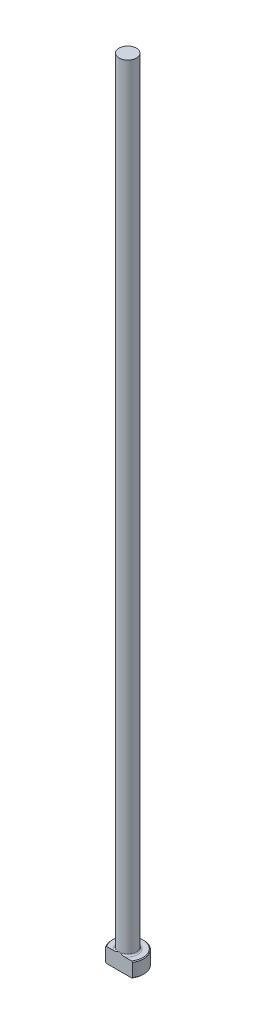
from build123d import *

# Parameters (mm, degrees)
CHAMFER1_SIZE = 0.254
FILLET1_R     = 0.508
KEY_DEPTH     = 255.104649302


with BuildPart() as part:
    # Sketch1 → Revolve1 (revolve)
    with BuildSketch(Plane.XY, mode=Mode.PRIVATE) as revolve1_sk:
        Polygon((0, 0), (-5.1562, 0), (-5.1562, 4.7498), (-2.77749, 4.7498), (-2.77749, 254), (0, 254), align=None)
    revolve(revolve1_sk.sketch.rotate(Axis((0, 259.958771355, 0), (0, -1, 0)), 270), axis=Axis((0, 259.958771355, 0), (0, -1, 0)))

    # Chamfer1
    chamfer1_edges = [part.edges().sort_by_distance(p)[0] for p in [
        (0, 4.7498, -5.1562),
        (0, 0, -5.1562),
    ]]
    chamfer(chamfer1_edges, length=CHAMFER1_SIZE)

    # Fillet1
    fillet1_edges = [part.edges().sort_by_distance(p)[0] for p in [
        (0, 4.7498, -2.77749),
    ]]
    fillet(fillet1_edges, radius=FILLET1_R)

    # Sketch2 → Key (cut, through all)
    with BuildSketch(Plane(origin=(0, 0, 0), x_dir=(1, 0, 0), z_dir=(0, 1, 0))):
        with BuildLine():
            Line((-4.344185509, -2.77749), (4.344185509, -2.77749))
            ThreePointArc((4.344185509, -2.77749), (0, -5.1562), (-4.344185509, -2.77749))
        make_face()
    extrude(amount=KEY_DEPTH, mode=Mode.SUBTRACT)


solid = part.part
